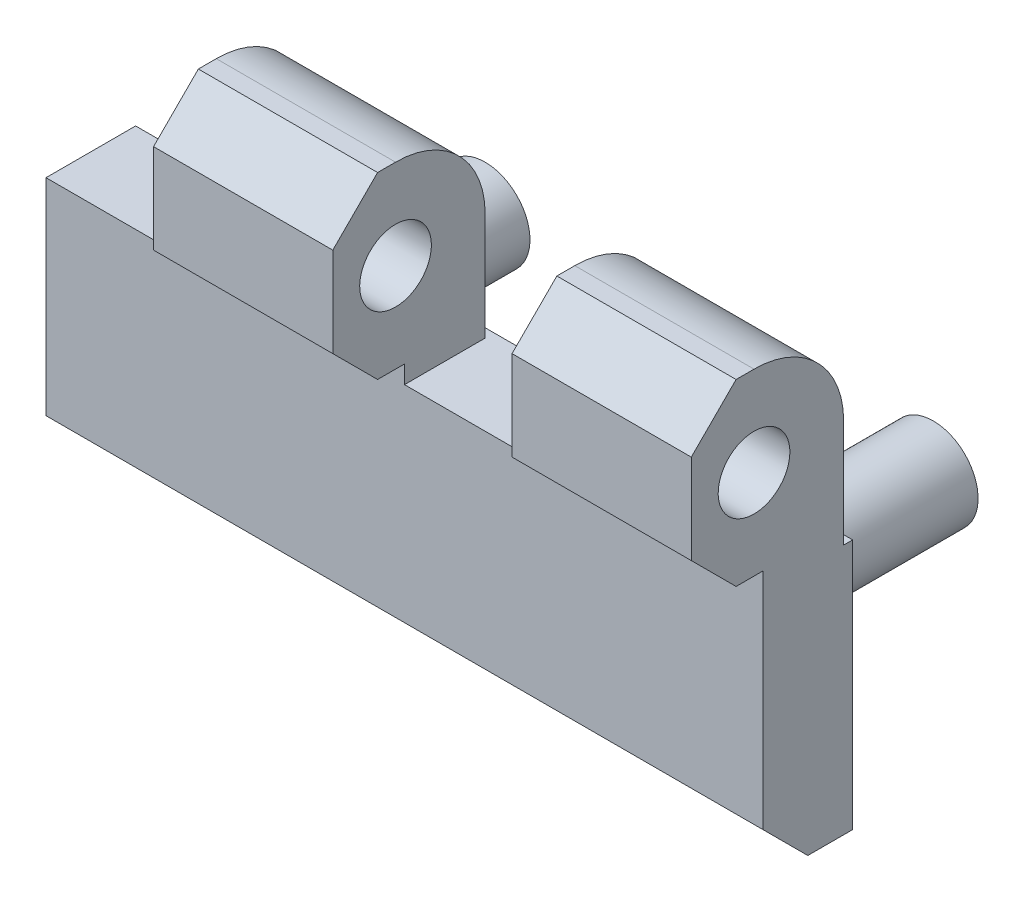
ISO-10303-21;
HEADER;
FILE_DESCRIPTION(('STEP AP214'),'2;1');
FILE_NAME('part.step','',(''),(''),'','','');
FILE_SCHEMA(('AUTOMOTIVE_DESIGN { 1 0 10303 214 1 1 1 1 }'));
ENDSEC;
DATA;
#1=APPLICATION_CONTEXT('core data for automotive mechanical design processes');
#2=APPLICATION_PROTOCOL_DEFINITION('international standard','automotive_design',2000,#1);
#3=PRODUCT_CONTEXT('',#1,'mechanical');
#4=PRODUCT('Part','Part','',(#3));
#5=PRODUCT_RELATED_PRODUCT_CATEGORY('part','',(#4));
#6=PRODUCT_DEFINITION_FORMATION('','',#4);
#7=PRODUCT_DEFINITION_CONTEXT('part definition',#1,'design');
#8=PRODUCT_DEFINITION('design','',#6,#7);
#9=PRODUCT_DEFINITION_SHAPE('','',#8);
#10=(LENGTH_UNIT() NAMED_UNIT(*) SI_UNIT(.MILLI.,.METRE.));
#11=(NAMED_UNIT(*) PLANE_ANGLE_UNIT() SI_UNIT($,.RADIAN.));
#12=(NAMED_UNIT(*) SI_UNIT($,.STERADIAN.) SOLID_ANGLE_UNIT());
#13=UNCERTAINTY_MEASURE_WITH_UNIT(LENGTH_MEASURE(1.E-05),#10,'distance_accuracy_value','');
#14=(GEOMETRIC_REPRESENTATION_CONTEXT(3) GLOBAL_UNCERTAINTY_ASSIGNED_CONTEXT((#13)) GLOBAL_UNIT_ASSIGNED_CONTEXT((#10,
#11,#12)) REPRESENTATION_CONTEXT('',''));
#15=CARTESIAN_POINT('',(0.,0.,0.));
#16=DIRECTION('',(0.,0.,1.));
#17=DIRECTION('',(1.,0.,0.));
#18=AXIS2_PLACEMENT_3D('',#15,#16,#17);
#19=CARTESIAN_POINT('',(-7.5,-7.5,0.));
#20=DIRECTION('',(0.,0.,-1.));
#21=DIRECTION('',(-1.,0.,0.));
#22=AXIS2_PLACEMENT_3D('',#19,#20,#21);
#23=PLANE('',#22);
#24=DIRECTION('',(1.,0.,0.));
#25=VECTOR('',#24,1.);
#26=CARTESIAN_POINT('',(-7.5,-7.5,0.));
#27=LINE('',#26,#25);
#28=CARTESIAN_POINT('',(-7.5,-7.5,0.));
#29=VERTEX_POINT('',#28);
#30=CARTESIAN_POINT('',(32.5,-7.5,0.));
#31=VERTEX_POINT('',#30);
#32=EDGE_CURVE('E350',#29,#31,#27,.T.);
#33=ORIENTED_EDGE('',*,*,#32,.F.);
#34=DIRECTION('',(0.,1.,0.));
#35=VECTOR('',#34,1.);
#36=CARTESIAN_POINT('',(-7.5,-7.5,0.));
#37=LINE('',#36,#35);
#38=CARTESIAN_POINT('',(-7.5,6.5,0.));
#39=VERTEX_POINT('',#38);
#40=EDGE_CURVE('E339',#29,#39,#37,.T.);
#41=ORIENTED_EDGE('',*,*,#40,.T.);
#42=DIRECTION('',(1.,0.,0.));
#43=VECTOR('',#42,1.);
#44=CARTESIAN_POINT('',(-7.5,6.5,0.));
#45=LINE('',#44,#43);
#46=CARTESIAN_POINT('',(32.5,6.5,0.));
#47=VERTEX_POINT('',#46);
#48=EDGE_CURVE('E195',#39,#47,#45,.T.);
#49=ORIENTED_EDGE('',*,*,#48,.T.);
#50=DIRECTION('',(0.,1.,0.));
#51=VECTOR('',#50,1.);
#52=CARTESIAN_POINT('',(32.5,-7.5,0.));
#53=LINE('',#52,#51);
#54=EDGE_CURVE('E324',#31,#47,#53,.T.);
#55=ORIENTED_EDGE('',*,*,#54,.F.);
#56=EDGE_LOOP('',(#33,#41,#49,#55));
#57=FACE_BOUND('',#56,.T.);
#58=CARTESIAN_POINT('',(25.,0.,0.));
#59=DIRECTION('',(0.,0.,-1.));
#60=DIRECTION('',(-1.,0.,0.));
#61=AXIS2_PLACEMENT_3D('',#58,#59,#60);
#62=CIRCLE('',#61,2.5);
#63=CARTESIAN_POINT('',(22.5,0.,0.));
#64=VERTEX_POINT('',#63);
#65=EDGE_CURVE('E9',#64,#64,#62,.T.);
#66=ORIENTED_EDGE('',*,*,#65,.F.);
#67=EDGE_LOOP('',(#66));
#68=FACE_BOUND('',#67,.T.);
#69=CARTESIAN_POINT('',(0.,0.,0.));
#70=DIRECTION('',(0.,0.,-1.));
#71=DIRECTION('',(-1.,0.,0.));
#72=AXIS2_PLACEMENT_3D('',#69,#70,#71);
#73=CIRCLE('',#72,2.5);
#74=CARTESIAN_POINT('',(-2.5,0.,0.));
#75=VERTEX_POINT('',#74);
#76=EDGE_CURVE('E649',#75,#75,#73,.T.);
#77=ORIENTED_EDGE('',*,*,#76,.F.);
#78=EDGE_LOOP('',(#77));
#79=FACE_BOUND('',#78,.T.);
#80=ADVANCED_FACE('F14',(#57,#68,#79),#23,.T.);
#81=CARTESIAN_POINT('',(-7.5,12.5,5.5));
#82=DIRECTION('',(1.,0.,0.));
#83=DIRECTION('',(0.,1.,0.));
#84=AXIS2_PLACEMENT_3D('',#81,#82,#83);
#85=CYLINDRICAL_SURFACE('',#84,5.);
#86=DIRECTION('',(1.,0.,0.));
#87=VECTOR('',#86,1.);
#88=CARTESIAN_POINT('',(-7.5,12.5,0.5));
#89=LINE('',#88,#87);
#90=CARTESIAN_POINT('',(22.5,12.5,0.5));
#91=VERTEX_POINT('',#90);
#92=CARTESIAN_POINT('',(32.5,12.5,0.5));
#93=VERTEX_POINT('',#92);
#94=EDGE_CURVE('E190',#91,#93,#89,.T.);
#95=ORIENTED_EDGE('',*,*,#94,.F.);
#96=CARTESIAN_POINT('',(22.5,12.5,5.5));
#97=DIRECTION('',(-1.,0.,0.));
#98=DIRECTION('',(0.,-1.,0.));
#99=AXIS2_PLACEMENT_3D('',#96,#97,#98);
#100=CIRCLE('',#99,5.);
#101=CARTESIAN_POINT('',(22.5,17.5,5.5));
#102=VERTEX_POINT('',#101);
#103=EDGE_CURVE('E295',#91,#102,#100,.F.);
#104=ORIENTED_EDGE('',*,*,#103,.T.);
#105=DIRECTION('',(1.,0.,0.));
#106=VECTOR('',#105,1.);
#107=CARTESIAN_POINT('',(-7.5,17.5,5.5));
#108=LINE('',#107,#106);
#109=CARTESIAN_POINT('',(32.5,17.5,5.5));
#110=VERTEX_POINT('',#109);
#111=EDGE_CURVE('E345',#102,#110,#108,.T.);
#112=ORIENTED_EDGE('',*,*,#111,.T.);
#113=CARTESIAN_POINT('',(32.5,12.5,5.5));
#114=DIRECTION('',(1.,0.,0.));
#115=DIRECTION('',(0.,1.,0.));
#116=AXIS2_PLACEMENT_3D('',#113,#114,#115);
#117=CIRCLE('',#116,5.);
#118=EDGE_CURVE('E306',#93,#110,#117,.T.);
#119=ORIENTED_EDGE('',*,*,#118,.F.);
#120=EDGE_LOOP('',(#95,#104,#112,#119));
#121=FACE_BOUND('',#120,.T.);
#122=ADVANCED_FACE('F393',(#121),#85,.T.);
#123=CARTESIAN_POINT('',(12.5,12.5,5.5));
#124=DIRECTION('',(-1.,0.,0.));
#125=DIRECTION('',(0.,-1.,0.));
#126=AXIS2_PLACEMENT_3D('',#123,#124,#125);
#127=CIRCLE('',#126,5.);
#128=CARTESIAN_POINT('',(12.5,12.5,0.5));
#129=VERTEX_POINT('',#128);
#130=CARTESIAN_POINT('',(12.5,17.5,5.5));
#131=VERTEX_POINT('',#130);
#132=EDGE_CURVE('E279',#129,#131,#127,.F.);
#133=ORIENTED_EDGE('',*,*,#132,.F.);
#134=CARTESIAN_POINT('',(2.5,12.5,0.5));
#135=VERTEX_POINT('',#134);
#136=EDGE_CURVE('E193',#135,#129,#89,.T.);
#137=ORIENTED_EDGE('',*,*,#136,.F.);
#138=CARTESIAN_POINT('',(2.5,12.5,5.5));
#139=DIRECTION('',(-1.,0.,0.));
#140=DIRECTION('',(0.,-1.,0.));
#141=AXIS2_PLACEMENT_3D('',#138,#139,#140);
#142=CIRCLE('',#141,5.);
#143=CARTESIAN_POINT('',(2.5,17.5,5.5));
#144=VERTEX_POINT('',#143);
#145=EDGE_CURVE('E170',#135,#144,#142,.F.);
#146=ORIENTED_EDGE('',*,*,#145,.T.);
#147=EDGE_CURVE('E347',#144,#131,#108,.T.);
#148=ORIENTED_EDGE('',*,*,#147,.T.);
#149=EDGE_LOOP('',(#133,#137,#146,#148));
#150=FACE_BOUND('',#149,.T.);
#151=ADVANCED_FACE('F418',(#150),#85,.T.);
#152=CARTESIAN_POINT('',(-7.5,12.5,0.5));
#153=DIRECTION('',(0.,0.,1.));
#154=DIRECTION('',(0.,-1.,0.));
#155=AXIS2_PLACEMENT_3D('',#152,#153,#154);
#156=PLANE('',#155);
#157=DIRECTION('',(0.,-1.,0.));
#158=VECTOR('',#157,1.);
#159=CARTESIAN_POINT('',(22.5,12.5,0.5));
#160=LINE('',#159,#158);
#161=CARTESIAN_POINT('',(22.5,6.5,0.5));
#162=VERTEX_POINT('',#161);
#163=EDGE_CURVE('E253',#91,#162,#160,.T.);
#164=ORIENTED_EDGE('',*,*,#163,.F.);
#165=ORIENTED_EDGE('',*,*,#94,.T.);
#166=DIRECTION('',(0.,-1.,0.));
#167=VECTOR('',#166,1.);
#168=CARTESIAN_POINT('',(32.5,12.5,0.5));
#169=LINE('',#168,#167);
#170=CARTESIAN_POINT('',(32.5,6.5,0.5));
#171=VERTEX_POINT('',#170);
#172=EDGE_CURVE('E330',#93,#171,#169,.T.);
#173=ORIENTED_EDGE('',*,*,#172,.T.);
#174=DIRECTION('',(1.,0.,0.));
#175=VECTOR('',#174,1.);
#176=CARTESIAN_POINT('',(-7.5,6.5,0.5));
#177=LINE('',#176,#175);
#178=EDGE_CURVE('E191',#162,#171,#177,.T.);
#179=ORIENTED_EDGE('',*,*,#178,.F.);
#180=EDGE_LOOP('',(#164,#165,#173,#179));
#181=FACE_BOUND('',#180,.T.);
#182=ADVANCED_FACE('F16',(#181),#156,.F.);
#183=ORIENTED_EDGE('',*,*,#136,.T.);
#184=DIRECTION('',(0.,-1.,0.));
#185=VECTOR('',#184,1.);
#186=CARTESIAN_POINT('',(12.5,12.5,0.5));
#187=LINE('',#186,#185);
#188=CARTESIAN_POINT('',(12.5,6.5,0.5));
#189=VERTEX_POINT('',#188);
#190=EDGE_CURVE('E189',#129,#189,#187,.T.);
#191=ORIENTED_EDGE('',*,*,#190,.T.);
#192=CARTESIAN_POINT('',(2.5,6.5,0.5));
#193=VERTEX_POINT('',#192);
#194=EDGE_CURVE('E181',#193,#189,#177,.T.);
#195=ORIENTED_EDGE('',*,*,#194,.F.);
#196=DIRECTION('',(0.,-1.,0.));
#197=VECTOR('',#196,1.);
#198=CARTESIAN_POINT('',(2.5,12.5,0.5));
#199=LINE('',#198,#197);
#200=EDGE_CURVE('E163',#135,#193,#199,.T.);
#201=ORIENTED_EDGE('',*,*,#200,.F.);
#202=EDGE_LOOP('',(#183,#191,#195,#201));
#203=FACE_BOUND('',#202,.T.);
#204=ADVANCED_FACE('F188',(#203),#156,.F.);
#205=CARTESIAN_POINT('',(-7.5,-7.5,5.));
#206=DIRECTION('',(0.,0.,-1.));
#207=DIRECTION('',(-1.,0.,0.));
#208=AXIS2_PLACEMENT_3D('',#205,#206,#207);
#209=PLANE('',#208);
#210=DIRECTION('',(0.,1.,0.));
#211=VECTOR('',#210,1.);
#212=CARTESIAN_POINT('',(22.5,-7.5,5.));
#213=LINE('',#212,#211);
#214=CARTESIAN_POINT('',(22.5,6.5,5.));
#215=VERTEX_POINT('',#214);
#216=CARTESIAN_POINT('',(22.5,7.5,5.));
#217=VERTEX_POINT('',#216);
#218=EDGE_CURVE('E243',#215,#217,#213,.T.);
#219=ORIENTED_EDGE('',*,*,#218,.F.);
#220=DIRECTION('',(-1.,0.,0.));
#221=VECTOR('',#220,1.);
#222=CARTESIAN_POINT('',(-7.5,6.5,5.));
#223=LINE('',#222,#221);
#224=CARTESIAN_POINT('',(12.5,6.5,5.));
#225=VERTEX_POINT('',#224);
#226=EDGE_CURVE('E18',#215,#225,#223,.T.);
#227=ORIENTED_EDGE('',*,*,#226,.T.);
#228=DIRECTION('',(0.,1.,0.));
#229=VECTOR('',#228,1.);
#230=CARTESIAN_POINT('',(12.5,-7.5,5.));
#231=LINE('',#230,#229);
#232=CARTESIAN_POINT('',(12.5,7.5,5.));
#233=VERTEX_POINT('',#232);
#234=EDGE_CURVE('E240',#225,#233,#231,.T.);
#235=ORIENTED_EDGE('',*,*,#234,.T.);
#236=DIRECTION('',(1.,0.,0.));
#237=VECTOR('',#236,1.);
#238=CARTESIAN_POINT('',(-7.5,7.5,5.));
#239=LINE('',#238,#237);
#240=CARTESIAN_POINT('',(2.5,7.5,5.));
#241=VERTEX_POINT('',#240);
#242=EDGE_CURVE('E349',#241,#233,#239,.T.);
#243=ORIENTED_EDGE('',*,*,#242,.F.);
#244=DIRECTION('',(0.,1.,0.));
#245=VECTOR('',#244,1.);
#246=CARTESIAN_POINT('',(2.5,-7.5,5.));
#247=LINE('',#246,#245);
#248=CARTESIAN_POINT('',(2.5,6.5,5.));
#249=VERTEX_POINT('',#248);
#250=EDGE_CURVE('E260',#249,#241,#247,.T.);
#251=ORIENTED_EDGE('',*,*,#250,.F.);
#252=DIRECTION('',(-1.,0.,0.));
#253=VECTOR('',#252,1.);
#254=CARTESIAN_POINT('',(-7.5,6.5,5.));
#255=LINE('',#254,#253);
#256=CARTESIAN_POINT('',(-7.5,6.5,5.));
#257=VERTEX_POINT('',#256);
#258=EDGE_CURVE('E183',#249,#257,#255,.T.);
#259=ORIENTED_EDGE('',*,*,#258,.T.);
#260=DIRECTION('',(0.,1.,0.));
#261=VECTOR('',#260,1.);
#262=CARTESIAN_POINT('',(-7.5,-7.5,5.));
#263=LINE('',#262,#261);
#264=CARTESIAN_POINT('',(-7.5,-5.,5.));
#265=VERTEX_POINT('',#264);
#266=EDGE_CURVE('E333',#265,#257,#263,.T.);
#267=ORIENTED_EDGE('',*,*,#266,.F.);
#268=DIRECTION('',(1.,0.,0.));
#269=VECTOR('',#268,1.);
#270=CARTESIAN_POINT('',(-7.5,-5.,5.));
#271=LINE('',#270,#269);
#272=CARTESIAN_POINT('',(32.5,-5.,5.));
#273=VERTEX_POINT('',#272);
#274=EDGE_CURVE('E221',#265,#273,#271,.T.);
#275=ORIENTED_EDGE('',*,*,#274,.T.);
#276=DIRECTION('',(0.,1.,0.));
#277=VECTOR('',#276,1.);
#278=CARTESIAN_POINT('',(32.5,-7.5,5.));
#279=LINE('',#278,#277);
#280=CARTESIAN_POINT('',(32.5,7.5,5.));
#281=VERTEX_POINT('',#280);
#282=EDGE_CURVE('E318',#273,#281,#279,.T.);
#283=ORIENTED_EDGE('',*,*,#282,.T.);
#284=EDGE_CURVE('E348',#217,#281,#239,.T.);
#285=ORIENTED_EDGE('',*,*,#284,.F.);
#286=EDGE_LOOP('',(#219,#227,#235,#243,#251,#259,#267,#275,#283,#285));
#287=FACE_BOUND('',#286,.T.);
#288=ADVANCED_FACE('F238',(#287),#209,.F.);
#289=CARTESIAN_POINT('',(-7.5,7.5,9.));
#290=DIRECTION('',(0.,-1.,0.));
#291=DIRECTION('',(0.,0.,-1.));
#292=AXIS2_PLACEMENT_3D('',#289,#290,#291);
#293=PLANE('',#292);
#294=DIRECTION('',(-1.,0.,0.));
#295=VECTOR('',#294,1.);
#296=CARTESIAN_POINT('',(-7.5,7.5,6.5));
#297=LINE('',#296,#295);
#298=CARTESIAN_POINT('',(32.5,7.5,6.5));
#299=VERTEX_POINT('',#298);
#300=CARTESIAN_POINT('',(22.5,7.5,6.5));
#301=VERTEX_POINT('',#300);
#302=EDGE_CURVE('E218',#299,#301,#297,.T.);
#303=ORIENTED_EDGE('',*,*,#302,.T.);
#304=DIRECTION('',(0.,0.,-1.));
#305=VECTOR('',#304,1.);
#306=CARTESIAN_POINT('',(22.5,7.5,9.));
#307=LINE('',#306,#305);
#308=EDGE_CURVE('E287',#301,#217,#307,.T.);
#309=ORIENTED_EDGE('',*,*,#308,.T.);
#310=ORIENTED_EDGE('',*,*,#284,.T.);
#311=DIRECTION('',(0.,0.,-1.));
#312=VECTOR('',#311,1.);
#313=CARTESIAN_POINT('',(32.5,7.5,9.));
#314=LINE('',#313,#312);
#315=EDGE_CURVE('E315',#299,#281,#314,.T.);
#316=ORIENTED_EDGE('',*,*,#315,.F.);
#317=EDGE_LOOP('',(#303,#309,#310,#316));
#318=FACE_BOUND('',#317,.T.);
#319=ADVANCED_FACE('F376',(#318),#293,.T.);
#320=DIRECTION('',(0.,0.,-1.));
#321=VECTOR('',#320,1.);
#322=CARTESIAN_POINT('',(12.5,7.5,9.));
#323=LINE('',#322,#321);
#324=CARTESIAN_POINT('',(12.5,7.5,6.5));
#325=VERTEX_POINT('',#324);
#326=EDGE_CURVE('E271',#325,#233,#323,.T.);
#327=ORIENTED_EDGE('',*,*,#326,.F.);
#328=CARTESIAN_POINT('',(2.5,7.5,6.5));
#329=VERTEX_POINT('',#328);
#330=EDGE_CURVE('E217',#325,#329,#297,.T.);
#331=ORIENTED_EDGE('',*,*,#330,.T.);
#332=DIRECTION('',(0.,0.,-1.));
#333=VECTOR('',#332,1.);
#334=CARTESIAN_POINT('',(2.5,7.5,9.));
#335=LINE('',#334,#333);
#336=EDGE_CURVE('E38',#329,#241,#335,.T.);
#337=ORIENTED_EDGE('',*,*,#336,.T.);
#338=ORIENTED_EDGE('',*,*,#242,.T.);
#339=EDGE_LOOP('',(#327,#331,#337,#338));
#340=FACE_BOUND('',#339,.T.);
#341=ADVANCED_FACE('F356',(#340),#293,.T.);
#342=CARTESIAN_POINT('',(-7.5,7.5,9.));
#343=DIRECTION('',(0.,0.,-1.));
#344=DIRECTION('',(0.,1.,0.));
#345=AXIS2_PLACEMENT_3D('',#342,#343,#344);
#346=PLANE('',#345);
#347=DIRECTION('',(0.,1.,0.));
#348=VECTOR('',#347,1.);
#349=CARTESIAN_POINT('',(22.5,7.5,9.));
#350=LINE('',#349,#348);
#351=CARTESIAN_POINT('',(22.5,10.,9.));
#352=VERTEX_POINT('',#351);
#353=CARTESIAN_POINT('',(22.5,15.,9.));
#354=VERTEX_POINT('',#353);
#355=EDGE_CURVE('E285',#352,#354,#350,.T.);
#356=ORIENTED_EDGE('',*,*,#355,.F.);
#357=DIRECTION('',(1.,0.,0.));
#358=VECTOR('',#357,1.);
#359=CARTESIAN_POINT('',(32.5,10.,9.));
#360=LINE('',#359,#358);
#361=CARTESIAN_POINT('',(32.5,10.,9.));
#362=VERTEX_POINT('',#361);
#363=EDGE_CURVE('E208',#352,#362,#360,.T.);
#364=ORIENTED_EDGE('',*,*,#363,.T.);
#365=DIRECTION('',(0.,1.,0.));
#366=VECTOR('',#365,1.);
#367=CARTESIAN_POINT('',(32.5,7.5,9.));
#368=LINE('',#367,#366);
#369=CARTESIAN_POINT('',(32.5,15.,9.));
#370=VERTEX_POINT('',#369);
#371=EDGE_CURVE('E312',#362,#370,#368,.T.);
#372=ORIENTED_EDGE('',*,*,#371,.T.);
#373=DIRECTION('',(-1.,0.,0.));
#374=VECTOR('',#373,1.);
#375=CARTESIAN_POINT('',(-7.5,15.,9.));
#376=LINE('',#375,#374);
#377=EDGE_CURVE('E211',#370,#354,#376,.T.);
#378=ORIENTED_EDGE('',*,*,#377,.T.);
#379=EDGE_LOOP('',(#356,#364,#372,#378));
#380=FACE_BOUND('',#379,.T.);
#381=ADVANCED_FACE('F382',(#380),#346,.F.);
#382=CARTESIAN_POINT('',(2.5,10.,9.));
#383=VERTEX_POINT('',#382);
#384=CARTESIAN_POINT('',(12.5,10.,9.));
#385=VERTEX_POINT('',#384);
#386=EDGE_CURVE('E210',#383,#385,#360,.T.);
#387=ORIENTED_EDGE('',*,*,#386,.T.);
#388=DIRECTION('',(0.,1.,0.));
#389=VECTOR('',#388,1.);
#390=CARTESIAN_POINT('',(12.5,7.5,9.));
#391=LINE('',#390,#389);
#392=CARTESIAN_POINT('',(12.5,15.,9.));
#393=VERTEX_POINT('',#392);
#394=EDGE_CURVE('E30',#385,#393,#391,.T.);
#395=ORIENTED_EDGE('',*,*,#394,.T.);
#396=CARTESIAN_POINT('',(2.5,15.,9.));
#397=VERTEX_POINT('',#396);
#398=EDGE_CURVE('E215',#393,#397,#376,.T.);
#399=ORIENTED_EDGE('',*,*,#398,.T.);
#400=DIRECTION('',(0.,1.,0.));
#401=VECTOR('',#400,1.);
#402=CARTESIAN_POINT('',(2.5,7.5,9.));
#403=LINE('',#402,#401);
#404=EDGE_CURVE('E254',#383,#397,#403,.T.);
#405=ORIENTED_EDGE('',*,*,#404,.F.);
#406=EDGE_LOOP('',(#387,#395,#399,#405));
#407=FACE_BOUND('',#406,.T.);
#408=ADVANCED_FACE('F430',(#407),#346,.F.);
#409=CARTESIAN_POINT('',(-7.5,17.5,9.));
#410=DIRECTION('',(0.,-1.,0.));
#411=DIRECTION('',(0.,0.,-1.));
#412=AXIS2_PLACEMENT_3D('',#409,#410,#411);
#413=PLANE('',#412);
#414=DIRECTION('',(0.,0.,-1.));
#415=VECTOR('',#414,1.);
#416=CARTESIAN_POINT('',(22.5,17.5,9.));
#417=LINE('',#416,#415);
#418=CARTESIAN_POINT('',(22.5,17.5,6.5));
#419=VERTEX_POINT('',#418);
#420=EDGE_CURVE('E293',#419,#102,#417,.T.);
#421=ORIENTED_EDGE('',*,*,#420,.F.);
#422=DIRECTION('',(1.,0.,0.));
#423=VECTOR('',#422,1.);
#424=CARTESIAN_POINT('',(-7.5,17.5,6.5));
#425=LINE('',#424,#423);
#426=CARTESIAN_POINT('',(32.5,17.5,6.5));
#427=VERTEX_POINT('',#426);
#428=EDGE_CURVE('E199',#419,#427,#425,.T.);
#429=ORIENTED_EDGE('',*,*,#428,.T.);
#430=DIRECTION('',(0.,0.,-1.));
#431=VECTOR('',#430,1.);
#432=CARTESIAN_POINT('',(32.5,17.5,9.));
#433=LINE('',#432,#431);
#434=EDGE_CURVE('E309',#427,#110,#433,.T.);
#435=ORIENTED_EDGE('',*,*,#434,.T.);
#436=ORIENTED_EDGE('',*,*,#111,.F.);
#437=EDGE_LOOP('',(#421,#429,#435,#436));
#438=FACE_BOUND('',#437,.T.);
#439=ADVANCED_FACE('F389',(#438),#413,.F.);
#440=CARTESIAN_POINT('',(2.5,17.5,6.5));
#441=VERTEX_POINT('',#440);
#442=CARTESIAN_POINT('',(12.5,17.5,6.5));
#443=VERTEX_POINT('',#442);
#444=EDGE_CURVE('E201',#441,#443,#425,.T.);
#445=ORIENTED_EDGE('',*,*,#444,.T.);
#446=DIRECTION('',(0.,0.,-1.));
#447=VECTOR('',#446,1.);
#448=CARTESIAN_POINT('',(12.5,17.5,9.));
#449=LINE('',#448,#447);
#450=EDGE_CURVE('E276',#443,#131,#449,.T.);
#451=ORIENTED_EDGE('',*,*,#450,.T.);
#452=ORIENTED_EDGE('',*,*,#147,.F.);
#453=DIRECTION('',(0.,0.,-1.));
#454=VECTOR('',#453,1.);
#455=CARTESIAN_POINT('',(2.5,17.5,9.));
#456=LINE('',#455,#454);
#457=EDGE_CURVE('E265',#441,#144,#456,.T.);
#458=ORIENTED_EDGE('',*,*,#457,.F.);
#459=EDGE_LOOP('',(#445,#451,#452,#458));
#460=FACE_BOUND('',#459,.T.);
#461=ADVANCED_FACE('F429',(#460),#413,.F.);
#462=CARTESIAN_POINT('',(-7.5,12.5,5.5));
#463=DIRECTION('',(1.,0.,0.));
#464=DIRECTION('',(0.,1.,0.));
#465=AXIS2_PLACEMENT_3D('',#462,#463,#464);
#466=CYLINDRICAL_SURFACE('',#465,2.);
#467=CARTESIAN_POINT('',(32.5,12.5,5.5));
#468=DIRECTION('',(1.,0.,0.));
#469=DIRECTION('',(0.,1.,0.));
#470=AXIS2_PLACEMENT_3D('',#467,#468,#469);
#471=CIRCLE('',#470,2.);
#472=CARTESIAN_POINT('',(32.5,14.5,5.5));
#473=VERTEX_POINT('',#472);
#474=EDGE_CURVE('E303',#473,#473,#471,.T.);
#475=ORIENTED_EDGE('',*,*,#474,.T.);
#476=EDGE_LOOP('',(#475));
#477=FACE_BOUND('',#476,.T.);
#478=CARTESIAN_POINT('',(22.5,12.5,5.5));
#479=DIRECTION('',(-1.,0.,0.));
#480=DIRECTION('',(0.,-1.,0.));
#481=AXIS2_PLACEMENT_3D('',#478,#479,#480);
#482=CIRCLE('',#481,2.);
#483=CARTESIAN_POINT('',(22.5,10.5,5.5));
#484=VERTEX_POINT('',#483);
#485=EDGE_CURVE('E299',#484,#484,#482,.F.);
#486=ORIENTED_EDGE('',*,*,#485,.F.);
#487=EDGE_LOOP('',(#486));
#488=FACE_BOUND('',#487,.T.);
#489=ADVANCED_FACE('F508',(#477,#488),#466,.F.);
#490=CARTESIAN_POINT('',(-7.5,17.5,6.5));
#491=DIRECTION('',(0.,-0.707106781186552,-0.707106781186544));
#492=DIRECTION('',(0.,0.707106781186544,-0.707106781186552));
#493=AXIS2_PLACEMENT_3D('',#490,#491,#492);
#494=PLANE('',#493);
#495=ORIENTED_EDGE('',*,*,#428,.F.);
#496=DIRECTION('',(0.,0.707106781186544,-0.707106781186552));
#497=VECTOR('',#496,1.);
#498=CARTESIAN_POINT('',(22.5,17.5,6.5));
#499=LINE('',#498,#497);
#500=EDGE_CURVE('E290',#419,#354,#499,.F.);
#501=ORIENTED_EDGE('',*,*,#500,.T.);
#502=ORIENTED_EDGE('',*,*,#377,.F.);
#503=DIRECTION('',(0.,0.707106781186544,-0.707106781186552));
#504=VECTOR('',#503,1.);
#505=CARTESIAN_POINT('',(32.5,15.5,8.5));
#506=LINE('',#505,#504);
#507=EDGE_CURVE('E206',#427,#370,#506,.F.);
#508=ORIENTED_EDGE('',*,*,#507,.F.);
#509=EDGE_LOOP('',(#495,#501,#502,#508));
#510=FACE_BOUND('',#509,.T.);
#511=ADVANCED_FACE('F385',(#510),#494,.F.);
#512=DIRECTION('',(0.,0.707106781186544,-0.707106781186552));
#513=VECTOR('',#512,1.);
#514=CARTESIAN_POINT('',(12.5,17.5,6.5));
#515=LINE('',#514,#513);
#516=EDGE_CURVE('E274',#443,#393,#515,.F.);
#517=ORIENTED_EDGE('',*,*,#516,.F.);
#518=ORIENTED_EDGE('',*,*,#444,.F.);
#519=DIRECTION('',(0.,0.707106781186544,-0.707106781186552));
#520=VECTOR('',#519,1.);
#521=CARTESIAN_POINT('',(2.5,17.5,6.5));
#522=LINE('',#521,#520);
#523=EDGE_CURVE('E262',#441,#397,#522,.F.);
#524=ORIENTED_EDGE('',*,*,#523,.T.);
#525=ORIENTED_EDGE('',*,*,#398,.F.);
#526=EDGE_LOOP('',(#517,#518,#524,#525));
#527=FACE_BOUND('',#526,.T.);
#528=ADVANCED_FACE('F527',(#527),#494,.F.);
#529=CARTESIAN_POINT('',(-7.5,10.,9.));
#530=DIRECTION('',(0.,-0.707106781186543,0.707106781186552));
#531=DIRECTION('',(0.,-0.707106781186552,-0.707106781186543));
#532=AXIS2_PLACEMENT_3D('',#529,#530,#531);
#533=PLANE('',#532);
#534=ORIENTED_EDGE('',*,*,#363,.F.);
#535=DIRECTION('',(0.,-0.707106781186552,-0.707106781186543));
#536=VECTOR('',#535,1.);
#537=CARTESIAN_POINT('',(22.5,10.,9.));
#538=LINE('',#537,#536);
#539=EDGE_CURVE('E229',#352,#301,#538,.T.);
#540=ORIENTED_EDGE('',*,*,#539,.T.);
#541=ORIENTED_EDGE('',*,*,#302,.F.);
#542=DIRECTION('',(0.,-0.707106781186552,-0.707106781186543));
#543=VECTOR('',#542,1.);
#544=CARTESIAN_POINT('',(32.5,9.5,8.5));
#545=LINE('',#544,#543);
#546=EDGE_CURVE('E204',#362,#299,#545,.T.);
#547=ORIENTED_EDGE('',*,*,#546,.F.);
#548=EDGE_LOOP('',(#534,#540,#541,#547));
#549=FACE_BOUND('',#548,.T.);
#550=ADVANCED_FACE('F377',(#549),#533,.T.);
#551=DIRECTION('',(0.,-0.707106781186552,-0.707106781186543));
#552=VECTOR('',#551,1.);
#553=CARTESIAN_POINT('',(12.5,10.,9.));
#554=LINE('',#553,#552);
#555=EDGE_CURVE('E228',#385,#325,#554,.T.);
#556=ORIENTED_EDGE('',*,*,#555,.F.);
#557=ORIENTED_EDGE('',*,*,#386,.F.);
#558=DIRECTION('',(0.,-0.707106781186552,-0.707106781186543));
#559=VECTOR('',#558,1.);
#560=CARTESIAN_POINT('',(2.5,10.,9.));
#561=LINE('',#560,#559);
#562=EDGE_CURVE('E226',#383,#329,#561,.T.);
#563=ORIENTED_EDGE('',*,*,#562,.T.);
#564=ORIENTED_EDGE('',*,*,#330,.F.);
#565=EDGE_LOOP('',(#556,#557,#563,#564));
#566=FACE_BOUND('',#565,.T.);
#567=ADVANCED_FACE('F410',(#566),#533,.T.);
#568=CARTESIAN_POINT('',(-7.5,6.5,0.5));
#569=DIRECTION('',(0.,-1.,0.));
#570=DIRECTION('',(0.,0.,-1.));
#571=AXIS2_PLACEMENT_3D('',#568,#569,#570);
#572=PLANE('',#571);
#573=DIRECTION('',(0.,0.,-1.));
#574=VECTOR('',#573,1.);
#575=CARTESIAN_POINT('',(-7.5,6.5,0.5));
#576=LINE('',#575,#574);
#577=EDGE_CURVE('E342',#257,#39,#576,.T.);
#578=ORIENTED_EDGE('',*,*,#577,.F.);
#579=ORIENTED_EDGE('',*,*,#258,.F.);
#580=DIRECTION('',(0.,0.,1.));
#581=VECTOR('',#580,1.);
#582=CARTESIAN_POINT('',(2.5,6.5,-11.));
#583=LINE('',#582,#581);
#584=EDGE_CURVE('E167',#193,#249,#583,.T.);
#585=ORIENTED_EDGE('',*,*,#584,.F.);
#586=ORIENTED_EDGE('',*,*,#194,.T.);
#587=DIRECTION('',(0.,0.,1.));
#588=VECTOR('',#587,1.);
#589=CARTESIAN_POINT('',(12.5,6.5,-11.));
#590=LINE('',#589,#588);
#591=EDGE_CURVE('E184',#189,#225,#590,.T.);
#592=ORIENTED_EDGE('',*,*,#591,.T.);
#593=ORIENTED_EDGE('',*,*,#226,.F.);
#594=DIRECTION('',(0.,0.,1.));
#595=VECTOR('',#594,1.);
#596=CARTESIAN_POINT('',(22.5,6.5,-11.));
#597=LINE('',#596,#595);
#598=EDGE_CURVE('E246',#162,#215,#597,.T.);
#599=ORIENTED_EDGE('',*,*,#598,.F.);
#600=ORIENTED_EDGE('',*,*,#178,.T.);
#601=DIRECTION('',(0.,0.,-1.));
#602=VECTOR('',#601,1.);
#603=CARTESIAN_POINT('',(32.5,6.5,0.5));
#604=LINE('',#603,#602);
#605=EDGE_CURVE('E327',#171,#47,#604,.T.);
#606=ORIENTED_EDGE('',*,*,#605,.T.);
#607=ORIENTED_EDGE('',*,*,#48,.F.);
#608=EDGE_LOOP('',(#578,#579,#585,#586,#592,#593,#599,#600,#606,#607));
#609=FACE_BOUND('',#608,.T.);
#610=ADVANCED_FACE('F179',(#609),#572,.F.);
#611=CARTESIAN_POINT('',(-7.5,-7.5,0.));
#612=DIRECTION('',(0.,1.,0.));
#613=DIRECTION('',(0.,0.,1.));
#614=AXIS2_PLACEMENT_3D('',#611,#612,#613);
#615=PLANE('',#614);
#616=DIRECTION('',(0.,0.,1.));
#617=VECTOR('',#616,1.);
#618=CARTESIAN_POINT('',(32.5,-7.5,0.));
#619=LINE('',#618,#617);
#620=CARTESIAN_POINT('',(32.5,-7.5,2.5));
#621=VERTEX_POINT('',#620);
#622=EDGE_CURVE('E321',#31,#621,#619,.T.);
#623=ORIENTED_EDGE('',*,*,#622,.T.);
#624=DIRECTION('',(-1.,0.,0.));
#625=VECTOR('',#624,1.);
#626=CARTESIAN_POINT('',(-7.5,-7.5,2.5));
#627=LINE('',#626,#625);
#628=CARTESIAN_POINT('',(-7.5,-7.5,2.5));
#629=VERTEX_POINT('',#628);
#630=EDGE_CURVE('E224',#621,#629,#627,.T.);
#631=ORIENTED_EDGE('',*,*,#630,.T.);
#632=DIRECTION('',(0.,0.,1.));
#633=VECTOR('',#632,1.);
#634=CARTESIAN_POINT('',(-7.5,-7.5,0.));
#635=LINE('',#634,#633);
#636=EDGE_CURVE('E336',#29,#629,#635,.T.);
#637=ORIENTED_EDGE('',*,*,#636,.F.);
#638=ORIENTED_EDGE('',*,*,#32,.T.);
#639=EDGE_LOOP('',(#623,#631,#637,#638));
#640=FACE_BOUND('',#639,.T.);
#641=ADVANCED_FACE('F400',(#640),#615,.F.);
#642=CARTESIAN_POINT('',(-7.5,12.5,5.5));
#643=DIRECTION('',(1.,0.,0.));
#644=DIRECTION('',(0.,1.,0.));
#645=AXIS2_PLACEMENT_3D('',#642,#643,#644);
#646=PLANE('',#645);
#647=ORIENTED_EDGE('',*,*,#266,.T.);
#648=ORIENTED_EDGE('',*,*,#577,.T.);
#649=ORIENTED_EDGE('',*,*,#40,.F.);
#650=ORIENTED_EDGE('',*,*,#636,.T.);
#651=DIRECTION('',(0.,-0.707106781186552,-0.707106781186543));
#652=VECTOR('',#651,1.);
#653=CARTESIAN_POINT('',(-7.5,-5.,5.));
#654=LINE('',#653,#652);
#655=EDGE_CURVE('E214',#629,#265,#654,.F.);
#656=ORIENTED_EDGE('',*,*,#655,.T.);
#657=EDGE_LOOP('',(#647,#648,#649,#650,#656));
#658=FACE_BOUND('',#657,.T.);
#659=ADVANCED_FACE('F362',(#658),#646,.F.);
#660=CARTESIAN_POINT('',(32.5,12.5,5.5));
#661=DIRECTION('',(1.,0.,0.));
#662=DIRECTION('',(0.,1.,0.));
#663=AXIS2_PLACEMENT_3D('',#660,#661,#662);
#664=PLANE('',#663);
#665=ORIENTED_EDGE('',*,*,#474,.F.);
#666=EDGE_LOOP('',(#665));
#667=FACE_BOUND('',#666,.T.);
#668=ORIENTED_EDGE('',*,*,#434,.F.);
#669=ORIENTED_EDGE('',*,*,#507,.T.);
#670=ORIENTED_EDGE('',*,*,#371,.F.);
#671=ORIENTED_EDGE('',*,*,#546,.T.);
#672=ORIENTED_EDGE('',*,*,#315,.T.);
#673=ORIENTED_EDGE('',*,*,#282,.F.);
#674=DIRECTION('',(0.,0.707106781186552,0.707106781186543));
#675=VECTOR('',#674,1.);
#676=CARTESIAN_POINT('',(32.5,4.00000000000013,14.));
#677=LINE('',#676,#675);
#678=EDGE_CURVE('E202',#273,#621,#677,.F.);
#679=ORIENTED_EDGE('',*,*,#678,.T.);
#680=ORIENTED_EDGE('',*,*,#622,.F.);
#681=ORIENTED_EDGE('',*,*,#54,.T.);
#682=ORIENTED_EDGE('',*,*,#605,.F.);
#683=ORIENTED_EDGE('',*,*,#172,.F.);
#684=ORIENTED_EDGE('',*,*,#118,.T.);
#685=EDGE_LOOP('',(#668,#669,#670,#671,#672,#673,#679,#680,#681,#682,#683,#684));
#686=FACE_BOUND('',#685,.T.);
#687=ADVANCED_FACE('F371',(#667,#686),#664,.T.);
#688=CARTESIAN_POINT('',(-7.5,-5.,5.));
#689=DIRECTION('',(0.,0.707106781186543,-0.707106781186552));
#690=DIRECTION('',(0.,0.707106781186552,0.707106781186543));
#691=AXIS2_PLACEMENT_3D('',#688,#689,#690);
#692=PLANE('',#691);
#693=ORIENTED_EDGE('',*,*,#655,.F.);
#694=ORIENTED_EDGE('',*,*,#630,.F.);
#695=ORIENTED_EDGE('',*,*,#678,.F.);
#696=ORIENTED_EDGE('',*,*,#274,.F.);
#697=EDGE_LOOP('',(#693,#694,#695,#696));
#698=FACE_BOUND('',#697,.T.);
#699=ADVANCED_FACE('F367',(#698),#692,.F.);
#700=CARTESIAN_POINT('',(2.5,32.5,-11.));
#701=DIRECTION('',(-1.,0.,0.));
#702=DIRECTION('',(0.,-1.,0.));
#703=AXIS2_PLACEMENT_3D('',#700,#701,#702);
#704=PLANE('',#703);
#705=ORIENTED_EDGE('',*,*,#200,.T.);
#706=ORIENTED_EDGE('',*,*,#584,.T.);
#707=ORIENTED_EDGE('',*,*,#250,.T.);
#708=ORIENTED_EDGE('',*,*,#336,.F.);
#709=ORIENTED_EDGE('',*,*,#562,.F.);
#710=ORIENTED_EDGE('',*,*,#404,.T.);
#711=ORIENTED_EDGE('',*,*,#523,.F.);
#712=ORIENTED_EDGE('',*,*,#457,.T.);
#713=ORIENTED_EDGE('',*,*,#145,.F.);
#714=EDGE_LOOP('',(#705,#706,#707,#708,#709,#710,#711,#712,#713));
#715=FACE_BOUND('',#714,.T.);
#716=CARTESIAN_POINT('',(2.5,12.5,5.5));
#717=DIRECTION('',(-1.,0.,0.));
#718=DIRECTION('',(0.,-1.,0.));
#719=AXIS2_PLACEMENT_3D('',#716,#717,#718);
#720=CIRCLE('',#719,2.);
#721=CARTESIAN_POINT('',(2.5,10.5,5.5));
#722=VERTEX_POINT('',#721);
#723=EDGE_CURVE('E175',#722,#722,#720,.F.);
#724=ORIENTED_EDGE('',*,*,#723,.T.);
#725=EDGE_LOOP('',(#724));
#726=FACE_BOUND('',#725,.T.);
#727=ADVANCED_FACE('F165',(#715,#726),#704,.T.);
#728=CARTESIAN_POINT('',(22.5,32.5,-11.));
#729=DIRECTION('',(-1.,0.,0.));
#730=DIRECTION('',(0.,-1.,0.));
#731=AXIS2_PLACEMENT_3D('',#728,#729,#730);
#732=PLANE('',#731);
#733=ORIENTED_EDGE('',*,*,#163,.T.);
#734=ORIENTED_EDGE('',*,*,#598,.T.);
#735=ORIENTED_EDGE('',*,*,#218,.T.);
#736=ORIENTED_EDGE('',*,*,#308,.F.);
#737=ORIENTED_EDGE('',*,*,#539,.F.);
#738=ORIENTED_EDGE('',*,*,#355,.T.);
#739=ORIENTED_EDGE('',*,*,#500,.F.);
#740=ORIENTED_EDGE('',*,*,#420,.T.);
#741=ORIENTED_EDGE('',*,*,#103,.F.);
#742=EDGE_LOOP('',(#733,#734,#735,#736,#737,#738,#739,#740,#741));
#743=FACE_BOUND('',#742,.T.);
#744=ORIENTED_EDGE('',*,*,#485,.T.);
#745=EDGE_LOOP('',(#744));
#746=FACE_BOUND('',#745,.T.);
#747=ADVANCED_FACE('F249',(#743,#746),#732,.T.);
#748=CARTESIAN_POINT('',(12.5,32.5,-11.));
#749=DIRECTION('',(-1.,0.,0.));
#750=DIRECTION('',(0.,-1.,0.));
#751=AXIS2_PLACEMENT_3D('',#748,#749,#750);
#752=PLANE('',#751);
#753=ORIENTED_EDGE('',*,*,#132,.T.);
#754=ORIENTED_EDGE('',*,*,#450,.F.);
#755=ORIENTED_EDGE('',*,*,#516,.T.);
#756=ORIENTED_EDGE('',*,*,#394,.F.);
#757=ORIENTED_EDGE('',*,*,#555,.T.);
#758=ORIENTED_EDGE('',*,*,#326,.T.);
#759=ORIENTED_EDGE('',*,*,#234,.F.);
#760=ORIENTED_EDGE('',*,*,#591,.F.);
#761=ORIENTED_EDGE('',*,*,#190,.F.);
#762=EDGE_LOOP('',(#753,#754,#755,#756,#757,#758,#759,#760,#761));
#763=FACE_BOUND('',#762,.T.);
#764=CARTESIAN_POINT('',(12.5,12.5,5.5));
#765=DIRECTION('',(-1.,0.,0.));
#766=DIRECTION('',(0.,-1.,0.));
#767=AXIS2_PLACEMENT_3D('',#764,#765,#766);
#768=CIRCLE('',#767,2.);
#769=CARTESIAN_POINT('',(12.5,10.5,5.5));
#770=VERTEX_POINT('',#769);
#771=EDGE_CURVE('E282',#770,#770,#768,.F.);
#772=ORIENTED_EDGE('',*,*,#771,.F.);
#773=EDGE_LOOP('',(#772));
#774=FACE_BOUND('',#773,.T.);
#775=ADVANCED_FACE('F586',(#763,#774),#752,.F.);
#776=ORIENTED_EDGE('',*,*,#771,.T.);
#777=EDGE_LOOP('',(#776));
#778=FACE_BOUND('',#777,.T.);
#779=ORIENTED_EDGE('',*,*,#723,.F.);
#780=EDGE_LOOP('',(#779));
#781=FACE_BOUND('',#780,.T.);
#782=ADVANCED_FACE('F519',(#778,#781),#466,.F.);
#783=CARTESIAN_POINT('',(25.,0.,-12.));
#784=DIRECTION('',(0.,0.,1.));
#785=DIRECTION('',(1.,0.,0.));
#786=AXIS2_PLACEMENT_3D('',#783,#784,#785);
#787=CYLINDRICAL_SURFACE('',#786,2.5);
#788=CARTESIAN_POINT('',(25.,0.,-12.));
#789=DIRECTION('',(0.,0.,-1.));
#790=DIRECTION('',(-1.,0.,0.));
#791=AXIS2_PLACEMENT_3D('',#788,#789,#790);
#792=CIRCLE('',#791,2.5);
#793=CARTESIAN_POINT('',(22.5,0.,-12.));
#794=VERTEX_POINT('',#793);
#795=EDGE_CURVE('E185',#794,#794,#792,.T.);
#796=ORIENTED_EDGE('',*,*,#795,.F.);
#797=EDGE_LOOP('',(#796));
#798=FACE_BOUND('',#797,.T.);
#799=ORIENTED_EDGE('',*,*,#65,.T.);
#800=EDGE_LOOP('',(#799));
#801=FACE_BOUND('',#800,.T.);
#802=ADVANCED_FACE('F603',(#798,#801),#787,.T.);
#803=CARTESIAN_POINT('',(25.,0.,-12.));
#804=DIRECTION('',(0.,0.,-1.));
#805=DIRECTION('',(-1.,0.,0.));
#806=AXIS2_PLACEMENT_3D('',#803,#804,#805);
#807=PLANE('',#806);
#808=ORIENTED_EDGE('',*,*,#795,.T.);
#809=EDGE_LOOP('',(#808));
#810=FACE_BOUND('',#809,.T.);
#811=ADVANCED_FACE('F605',(#810),#807,.T.);
#812=CARTESIAN_POINT('',(0.,0.,-12.));
#813=DIRECTION('',(0.,0.,1.));
#814=DIRECTION('',(1.,0.,0.));
#815=AXIS2_PLACEMENT_3D('',#812,#813,#814);
#816=CYLINDRICAL_SURFACE('',#815,2.5);
#817=CARTESIAN_POINT('',(0.,0.,-12.));
#818=DIRECTION('',(0.,0.,-1.));
#819=DIRECTION('',(-1.,0.,0.));
#820=AXIS2_PLACEMENT_3D('',#817,#818,#819);
#821=CIRCLE('',#820,2.5);
#822=CARTESIAN_POINT('',(-2.5,0.,-12.));
#823=VERTEX_POINT('',#822);
#824=EDGE_CURVE('E648',#823,#823,#821,.T.);
#825=ORIENTED_EDGE('',*,*,#824,.F.);
#826=EDGE_LOOP('',(#825));
#827=FACE_BOUND('',#826,.T.);
#828=ORIENTED_EDGE('',*,*,#76,.T.);
#829=EDGE_LOOP('',(#828));
#830=FACE_BOUND('',#829,.T.);
#831=ADVANCED_FACE('F623',(#827,#830),#816,.T.);
#832=CARTESIAN_POINT('',(0.,0.,-12.));
#833=DIRECTION('',(0.,0.,-1.));
#834=DIRECTION('',(-1.,0.,0.));
#835=AXIS2_PLACEMENT_3D('',#832,#833,#834);
#836=PLANE('',#835);
#837=ORIENTED_EDGE('',*,*,#824,.T.);
#838=EDGE_LOOP('',(#837));
#839=FACE_BOUND('',#838,.T.);
#840=ADVANCED_FACE('F615',(#839),#836,.T.);
#841=CLOSED_SHELL('',(#80,#122,#151,#182,#204,#288,#319,#341,#381,#408,#439,#461,#489,#511,#528,
#550,#567,#610,#641,#659,#687,#699,#727,#747,#775,#782,#802,#811,#831,#840));
#842=MANIFOLD_SOLID_BREP('B1',#841);
#843=ADVANCED_BREP_SHAPE_REPRESENTATION('',(#18,#842),#14);
#844=SHAPE_DEFINITION_REPRESENTATION(#9,#843);
ENDSEC;
END-ISO-10303-21;
